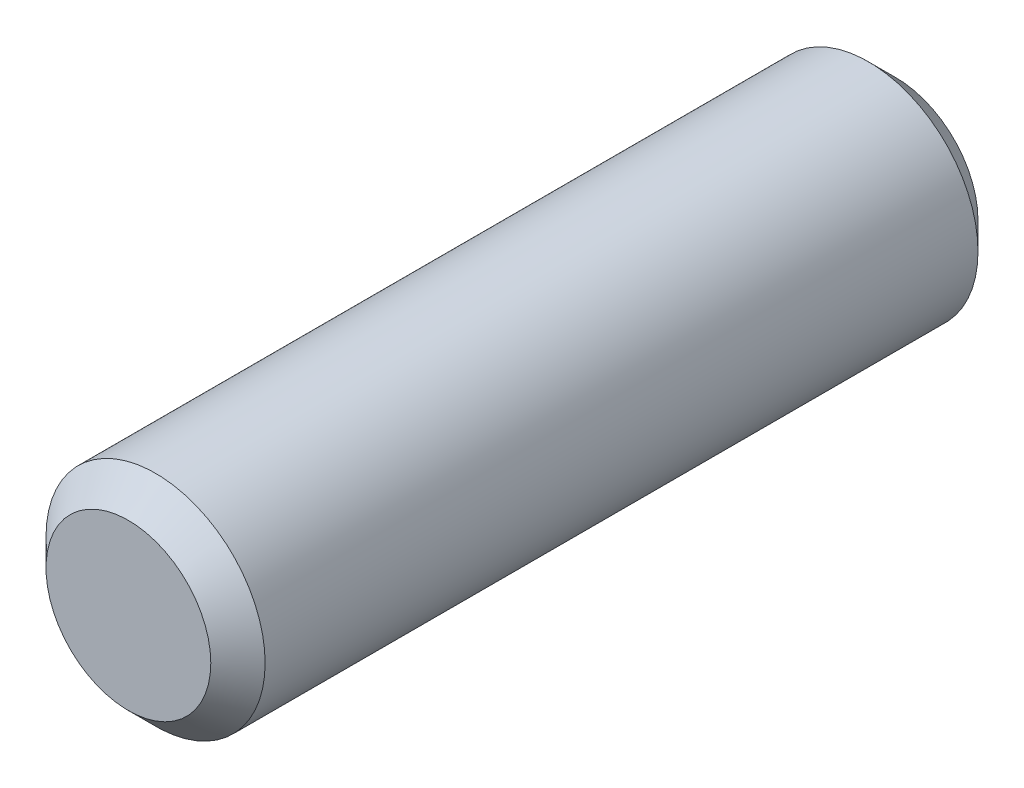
from build123d import *

# Parameters (mm, degrees)
PIN2_R         = 4.233333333
EXTRUDE1_DEPTH = 29.6418
CHAMFER1_SIZE  = 1.049866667


with BuildPart() as part:
    # PIN2 → Extrude1 (new body)
    with BuildSketch(Plane(origin=(0, 0, 0), x_dir=(-1, 0, 0), z_dir=(0, 0, 1))):
        with Locations(Location((0, 0, 0), (0, 0, 180))):
            Circle(PIN2_R)
    extrude(amount=EXTRUDE1_DEPTH)

    # Chamfer1
    chamfer1_edges = [part.edges().sort_by_distance(p)[0] for p in [
        (-4.233333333, 0, 0),
        (-4.233333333, 0, 29.6418),
    ]]
    chamfer(chamfer1_edges, length=CHAMFER1_SIZE)


solid = part.part
